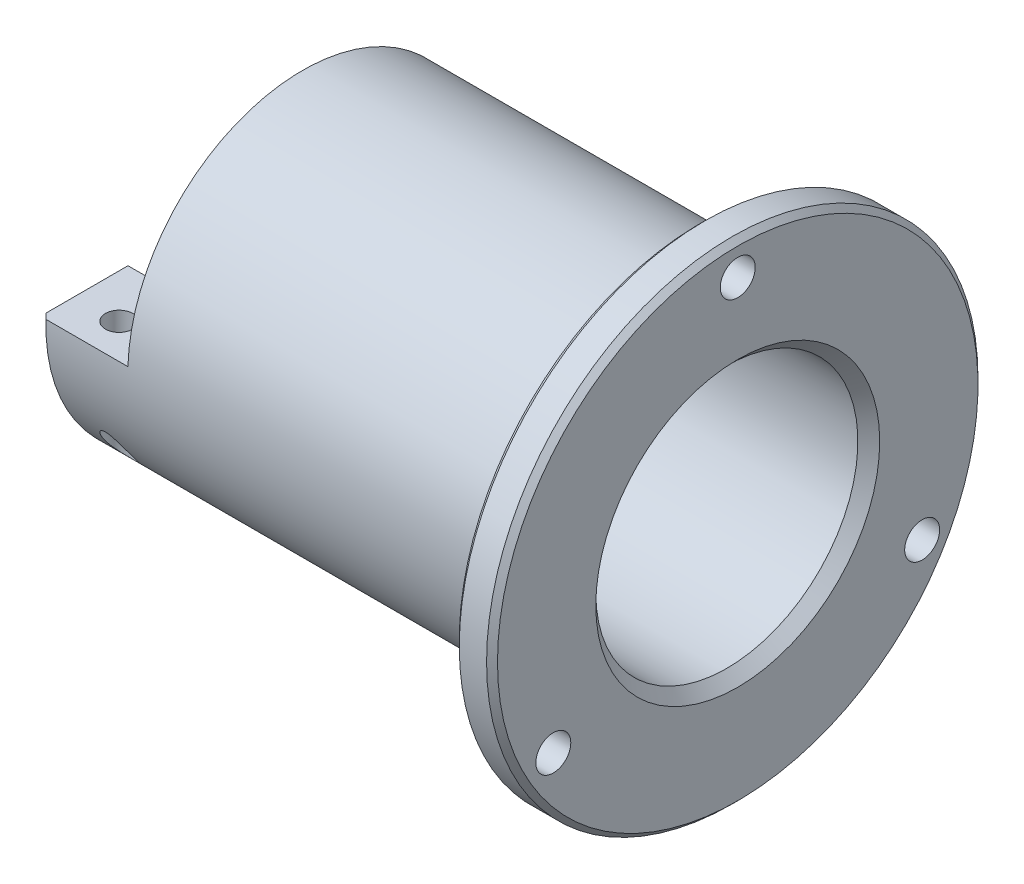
ISO-10303-21;
HEADER;
FILE_DESCRIPTION(('STEP AP214'),'2;1');
FILE_NAME('part.step','',(''),(''),'','','');
FILE_SCHEMA(('AUTOMOTIVE_DESIGN { 1 0 10303 214 1 1 1 1 }'));
ENDSEC;
DATA;
#1=APPLICATION_CONTEXT('core data for automotive mechanical design processes');
#2=APPLICATION_PROTOCOL_DEFINITION('international standard','automotive_design',2000,#1);
#3=PRODUCT_CONTEXT('',#1,'mechanical');
#4=PRODUCT('Part','Part','',(#3));
#5=PRODUCT_RELATED_PRODUCT_CATEGORY('part','',(#4));
#6=PRODUCT_DEFINITION_FORMATION('','',#4);
#7=PRODUCT_DEFINITION_CONTEXT('part definition',#1,'design');
#8=PRODUCT_DEFINITION('design','',#6,#7);
#9=PRODUCT_DEFINITION_SHAPE('','',#8);
#10=(LENGTH_UNIT() NAMED_UNIT(*) SI_UNIT(.MILLI.,.METRE.));
#11=(NAMED_UNIT(*) PLANE_ANGLE_UNIT() SI_UNIT($,.RADIAN.));
#12=(NAMED_UNIT(*) SI_UNIT($,.STERADIAN.) SOLID_ANGLE_UNIT());
#13=UNCERTAINTY_MEASURE_WITH_UNIT(LENGTH_MEASURE(1.E-05),#10,'distance_accuracy_value','');
#14=(GEOMETRIC_REPRESENTATION_CONTEXT(3) GLOBAL_UNCERTAINTY_ASSIGNED_CONTEXT((#13)) GLOBAL_UNIT_ASSIGNED_CONTEXT((#10,
#11,#12)) REPRESENTATION_CONTEXT('',''));
#15=CARTESIAN_POINT('',(0.,0.,0.));
#16=DIRECTION('',(0.,0.,1.));
#17=DIRECTION('',(1.,0.,0.));
#18=AXIS2_PLACEMENT_3D('',#15,#16,#17);
#19=CARTESIAN_POINT('',(0.,0.,0.));
#20=DIRECTION('',(-1.,0.,0.));
#21=DIRECTION('',(0.,0.,1.));
#22=AXIS2_PLACEMENT_3D('',#19,#20,#21);
#23=CYLINDRICAL_SURFACE('',#22,7.99999999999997);
#24=CARTESIAN_POINT('',(0.,0.,0.));
#25=DIRECTION('',(-1.,0.,0.));
#26=DIRECTION('',(0.,0.,1.));
#27=AXIS2_PLACEMENT_3D('',#24,#25,#26);
#28=CIRCLE('',#27,7.99999999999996);
#29=CARTESIAN_POINT('',(0.,0.5,-7.98435971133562));
#30=VERTEX_POINT('',#29);
#31=CARTESIAN_POINT('',(0.,0.5,7.98435971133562));
#32=VERTEX_POINT('',#31);
#33=EDGE_CURVE('E95',#30,#32,#28,.T.);
#34=ORIENTED_EDGE('',*,*,#33,.T.);
#35=DIRECTION('',(-1.,0.,0.));
#36=VECTOR('',#35,1.);
#37=CARTESIAN_POINT('',(8.,0.5,7.98435971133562));
#38=LINE('',#37,#36);
#39=CARTESIAN_POINT('',(8.,0.5,7.98435971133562));
#40=VERTEX_POINT('',#39);
#41=EDGE_CURVE('E97',#40,#32,#38,.T.);
#42=ORIENTED_EDGE('',*,*,#41,.F.);
#43=CARTESIAN_POINT('',(8.,0.,0.));
#44=DIRECTION('',(1.,0.,0.));
#45=DIRECTION('',(0.,0.,1.));
#46=AXIS2_PLACEMENT_3D('',#43,#44,#45);
#47=CIRCLE('',#46,7.99999999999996);
#48=CARTESIAN_POINT('',(8.,0.5,-7.98435971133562));
#49=VERTEX_POINT('',#48);
#50=EDGE_CURVE('E96',#49,#40,#47,.T.);
#51=ORIENTED_EDGE('',*,*,#50,.F.);
#52=DIRECTION('',(-1.,0.,0.));
#53=VECTOR('',#52,1.);
#54=CARTESIAN_POINT('',(8.,0.5,-7.98435971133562));
#55=LINE('',#54,#53);
#56=EDGE_CURVE('E79',#49,#30,#55,.T.);
#57=ORIENTED_EDGE('',*,*,#56,.T.);
#58=EDGE_LOOP('',(#34,#42,#51,#57));
#59=FACE_BOUND('',#58,.T.);
#60=CARTESIAN_POINT('',(9.4,0.,0.));
#61=DIRECTION('',(-1.,0.,0.));
#62=DIRECTION('',(0.,0.,1.));
#63=AXIS2_PLACEMENT_3D('',#60,#61,#62);
#64=CIRCLE('',#63,7.99999999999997);
#65=CARTESIAN_POINT('',(9.4,0.,7.99999999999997));
#66=VERTEX_POINT('',#65);
#67=EDGE_CURVE('E222',#66,#66,#64,.T.);
#68=ORIENTED_EDGE('',*,*,#67,.F.);
#69=EDGE_LOOP('',(#68));
#70=FACE_BOUND('',#69,.T.);
#71=ADVANCED_FACE('F29',(#59,#70),#23,.F.);
#72=CARTESIAN_POINT('',(0.,7.99999999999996,0.));
#73=DIRECTION('',(1.,0.,0.));
#74=DIRECTION('',(0.,0.,-1.));
#75=AXIS2_PLACEMENT_3D('',#72,#73,#74);
#76=PLANE('',#75);
#77=DIRECTION('',(0.,0.,1.));
#78=VECTOR('',#77,1.);
#79=CARTESIAN_POINT('',(0.,0.5,-15.9921855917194));
#80=LINE('',#79,#78);
#81=CARTESIAN_POINT('',(0.,0.5,-15.4919333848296));
#82=VERTEX_POINT('',#81);
#83=EDGE_CURVE('E76',#82,#30,#80,.T.);
#84=ORIENTED_EDGE('',*,*,#83,.F.);
#85=CARTESIAN_POINT('',(0.,0.,0.));
#86=DIRECTION('',(1.,0.,0.));
#87=DIRECTION('',(0.,0.,-1.));
#88=AXIS2_PLACEMENT_3D('',#85,#86,#87);
#89=CIRCLE('',#88,15.4999999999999);
#90=CARTESIAN_POINT('',(0.,0.5,15.4919333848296));
#91=VERTEX_POINT('',#90);
#92=EDGE_CURVE('E151',#82,#91,#89,.F.);
#93=ORIENTED_EDGE('',*,*,#92,.T.);
#94=DIRECTION('',(0.,0.,1.));
#95=VECTOR('',#94,1.);
#96=CARTESIAN_POINT('',(0.,0.5,7.98435971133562));
#97=LINE('',#96,#95);
#98=EDGE_CURVE('E87',#32,#91,#97,.T.);
#99=ORIENTED_EDGE('',*,*,#98,.F.);
#100=ORIENTED_EDGE('',*,*,#33,.F.);
#101=EDGE_LOOP('',(#84,#93,#99,#100));
#102=FACE_BOUND('',#101,.T.);
#103=ADVANCED_FACE('F101',(#102),#76,.F.);
#104=CARTESIAN_POINT('',(0.,0.,0.));
#105=DIRECTION('',(-1.,0.,0.));
#106=DIRECTION('',(0.,0.,1.));
#107=AXIS2_PLACEMENT_3D('',#104,#105,#106);
#108=CYLINDRICAL_SURFACE('',#107,15.9999999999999);
#109=CARTESIAN_POINT('',(43.85,0.,0.));
#110=DIRECTION('',(1.,0.,0.));
#111=DIRECTION('',(0.,0.,-1.));
#112=AXIS2_PLACEMENT_3D('',#109,#110,#111);
#113=CIRCLE('',#112,15.9999999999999);
#114=CARTESIAN_POINT('',(43.85,0.,-15.9999999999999));
#115=VERTEX_POINT('',#114);
#116=EDGE_CURVE('E36',#115,#115,#113,.F.);
#117=ORIENTED_EDGE('',*,*,#116,.T.);
#118=EDGE_LOOP('',(#117));
#119=FACE_BOUND('',#118,.T.);
#120=CARTESIAN_POINT('',(4.,-7.65490039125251,14.05));
#121=CARTESIAN_POINT('',(4.03648893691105,-7.65490362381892,14.0499983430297));
#122=CARTESIAN_POINT('',(4.0729920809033,-7.65786623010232,14.0483853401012));
#123=CARTESIAN_POINT('',(4.14483776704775,-7.66937298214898,14.0421066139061));
#124=CARTESIAN_POINT('',(4.18017886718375,-7.67792380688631,14.0374372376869));
#125=CARTESIAN_POINT('',(4.25747048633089,-7.7024947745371,14.0239727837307));
#126=CARTESIAN_POINT('',(4.29886138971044,-7.71984872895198,14.0144376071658));
#127=CARTESIAN_POINT('',(4.37793517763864,-7.7600660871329,13.9922086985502));
#128=CARTESIAN_POINT('',(4.41561000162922,-7.78294111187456,13.9795083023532));
#129=CARTESIAN_POINT('',(4.50929466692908,-7.84782819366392,13.9432303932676));
#130=CARTESIAN_POINT('',(4.56237255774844,-7.89297095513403,13.9177600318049));
#131=CARTESIAN_POINT('',(4.66042526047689,-7.98914034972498,13.8627824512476));
#132=CARTESIAN_POINT('',(4.70537832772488,-8.04018218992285,13.8332647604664));
#133=CARTESIAN_POINT('',(4.78563981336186,-8.14220535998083,13.7734436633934));
#134=CARTESIAN_POINT('',(4.82139814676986,-8.19295096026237,13.7433328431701));
#135=CARTESIAN_POINT('',(4.88785424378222,-8.29649931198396,13.6810728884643));
#136=CARTESIAN_POINT('',(4.91854784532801,-8.34930371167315,13.6489221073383));
#137=CARTESIAN_POINT('',(4.97546693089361,-8.45635377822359,13.5828585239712));
#138=CARTESIAN_POINT('',(5.00168369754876,-8.51060202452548,13.5489424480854));
#139=CARTESIAN_POINT('',(5.04995750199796,-8.61999147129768,13.4796122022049));
#140=CARTESIAN_POINT('',(5.07201343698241,-8.67513290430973,13.4441976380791));
#141=CARTESIAN_POINT('',(5.12141217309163,-8.81136989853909,13.3554876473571));
#142=CARTESIAN_POINT('',(5.14654629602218,-8.89277996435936,13.3014349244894));
#143=CARTESIAN_POINT('',(5.18880238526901,-9.05602520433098,13.1908355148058));
#144=CARTESIAN_POINT('',(5.20592019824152,-9.13786057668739,13.1342875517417));
#145=CARTESIAN_POINT('',(5.23206575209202,-9.30125401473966,13.0190880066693));
#146=CARTESIAN_POINT('',(5.24110007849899,-9.38281225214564,12.9604381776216));
#147=CARTESIAN_POINT('',(5.25073912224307,-9.54508531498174,12.8413969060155));
#148=CARTESIAN_POINT('',(5.25134820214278,-9.62580055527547,12.7810063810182));
#149=CARTESIAN_POINT('',(5.2419832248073,-9.81725162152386,12.6349189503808));
#150=CARTESIAN_POINT('',(5.22776313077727,-9.92734089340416,12.548589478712));
#151=CARTESIAN_POINT('',(5.17909455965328,-10.1424483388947,12.3753660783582));
#152=CARTESIAN_POINT('',(5.14468765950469,-10.247476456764,12.2884736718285));
#153=CARTESIAN_POINT('',(5.06697128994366,-10.4160662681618,12.1455150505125));
#154=CARTESIAN_POINT('',(5.03023867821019,-10.4819685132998,12.0886489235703));
#155=CARTESIAN_POINT('',(4.94434894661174,-10.6081682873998,11.9780527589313));
#156=CARTESIAN_POINT('',(4.89520836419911,-10.6684731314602,11.9243186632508));
#157=CARTESIAN_POINT('',(4.79793845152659,-10.7660230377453,11.8362106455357));
#158=CARTESIAN_POINT('',(4.75295792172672,-10.8051560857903,11.8004673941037));
#159=CARTESIAN_POINT('',(4.65522227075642,-10.8774572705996,11.7338538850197));
#160=CARTESIAN_POINT('',(4.60247844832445,-10.9106339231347,11.7029766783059));
#161=CARTESIAN_POINT('',(4.5010628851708,-10.9631921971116,11.6537309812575));
#162=CARTESIAN_POINT('',(4.45375583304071,-10.9840073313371,11.6340957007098));
#163=CARTESIAN_POINT('',(4.35505332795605,-11.0196365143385,11.6003540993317));
#164=CARTESIAN_POINT('',(4.30366032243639,-11.0344541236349,11.5862444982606));
#165=CARTESIAN_POINT('',(4.19763257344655,-11.0572103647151,11.5645300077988));
#166=CARTESIAN_POINT('',(4.14297828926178,-11.0651018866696,11.5569696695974));
#167=CARTESIAN_POINT('',(4.03258839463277,-11.0732087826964,11.5492026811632));
#168=CARTESIAN_POINT('',(3.97685330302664,-11.0734277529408,11.5489925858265));
#169=CARTESIAN_POINT('',(3.8724547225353,-11.0665879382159,11.555546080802));
#170=CARTESIAN_POINT('',(3.82368643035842,-11.0603252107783,11.5615468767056));
#171=CARTESIAN_POINT('',(3.72823269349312,-11.0421190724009,11.5789361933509));
#172=CARTESIAN_POINT('',(3.68154743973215,-11.0301751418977,11.5903252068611));
#173=CARTESIAN_POINT('',(3.58981961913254,-11.0007989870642,11.618211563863));
#174=CARTESIAN_POINT('',(3.54487510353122,-10.9832057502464,11.6348585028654));
#175=CARTESIAN_POINT('',(3.45887288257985,-10.9434907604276,11.6722215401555));
#176=CARTESIAN_POINT('',(3.41781716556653,-10.9213667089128,11.6929397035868));
#177=CARTESIAN_POINT('',(3.31929514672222,-10.8607109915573,11.7493591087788));
#178=CARTESIAN_POINT('',(3.26458796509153,-10.8196783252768,11.7872010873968));
#179=CARTESIAN_POINT('',(3.16477159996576,-10.7312323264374,11.8677825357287));
#180=CARTESIAN_POINT('',(3.11968623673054,-10.683803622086,11.9105337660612));
#181=CARTESIAN_POINT('',(3.01991714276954,-10.5615999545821,12.0192324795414));
#182=CARTESIAN_POINT('',(2.97025853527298,-10.4842309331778,12.0868543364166));
#183=CARTESIAN_POINT('',(2.88738709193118,-10.3232816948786,12.2246124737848));
#184=CARTESIAN_POINT('',(2.85420123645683,-10.2396915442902,12.2947526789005));
#185=CARTESIAN_POINT('',(2.8087001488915,-10.0903899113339,12.4173611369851));
#186=CARTESIAN_POINT('',(2.79322051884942,-10.0255566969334,12.469773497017));
#187=CARTESIAN_POINT('',(2.76939347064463,-9.89424925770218,12.574214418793));
#188=CARTESIAN_POINT('',(2.76104957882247,-9.82777423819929,12.626242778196));
#189=CARTESIAN_POINT('',(2.75090563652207,-9.69358217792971,12.7295582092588));
#190=CARTESIAN_POINT('',(2.74911770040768,-9.62586307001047,12.7808437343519));
#191=CARTESIAN_POINT('',(2.75167923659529,-9.48968835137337,12.8822755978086));
#192=CARTESIAN_POINT('',(2.75602951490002,-9.42123264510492,12.9324217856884));
#193=CARTESIAN_POINT('',(2.77085410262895,-9.28130971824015,13.0332270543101));
#194=CARTESIAN_POINT('',(2.78155711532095,-9.20982778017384,13.0838319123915));
#195=CARTESIAN_POINT('',(2.80909882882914,-9.06687677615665,13.1832971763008));
#196=CARTESIAN_POINT('',(2.82593506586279,-8.99540771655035,13.2321582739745));
#197=CARTESIAN_POINT('',(2.8657123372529,-8.85309185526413,13.3277939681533));
#198=CARTESIAN_POINT('',(2.88863508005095,-8.78224383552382,13.3745743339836));
#199=CARTESIAN_POINT('',(2.94084594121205,-8.64151597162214,13.4659285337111));
#200=CARTESIAN_POINT('',(2.97013062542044,-8.57163562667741,13.5105035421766));
#201=CARTESIAN_POINT('',(3.03558039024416,-8.43362400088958,13.5970810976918));
#202=CARTESIAN_POINT('',(3.07173776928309,-8.36549085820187,13.6390864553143));
#203=CARTESIAN_POINT('',(3.15204816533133,-8.23179312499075,13.7201928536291));
#204=CARTESIAN_POINT('',(3.19622518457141,-8.16623698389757,13.7592846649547));
#205=CARTESIAN_POINT('',(3.269983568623,-8.07111402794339,13.8151548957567));
#206=CARTESIAN_POINT('',(3.29604461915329,-8.0397168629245,13.8334444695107));
#207=CARTESIAN_POINT('',(3.35089880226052,-7.9786540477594,13.868753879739));
#208=CARTESIAN_POINT('',(3.37969349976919,-7.94898940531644,13.8857729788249));
#209=CARTESIAN_POINT('',(3.47038003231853,-7.86376406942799,13.9343238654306));
#210=CARTESIAN_POINT('',(3.53696623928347,-7.81143439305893,13.9636632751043));
#211=CARTESIAN_POINT('',(3.64328250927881,-7.7486882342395,13.9985124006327));
#212=CARTESIAN_POINT('',(3.67742592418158,-7.73112245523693,14.0082137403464));
#213=CARTESIAN_POINT('',(3.74837454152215,-7.7007155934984,14.024951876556));
#214=CARTESIAN_POINT('',(3.78517468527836,-7.68786580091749,14.0319935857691));
#215=CARTESIAN_POINT('',(3.85167189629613,-7.67047337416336,14.0415068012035));
#216=CARTESIAN_POINT('',(3.88094090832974,-7.66467454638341,14.0446710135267));
#217=CARTESIAN_POINT('',(3.94013682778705,-7.65688702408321,14.0489181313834));
#218=CARTESIAN_POINT('',(3.97006363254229,-7.65489773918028,14.0500013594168));
#219=CARTESIAN_POINT('',(4.,-7.65490039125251,14.05));
#220=B_SPLINE_CURVE_WITH_KNOTS('',3,(#120,#121,#122,#123,#124,#125,#126,#127,#128,#129,#130,
#131,#132,#133,#134,#135,#136,#137,#138,#139,#140,#141,#142,#143,#144,#145,#146,#147,#148,#149,
#150,#151,#152,#153,#154,#155,#156,#157,#158,#159,#160,#161,#162,#163,#164,#165,#166,#167,#168,
#169,#170,#171,#172,#173,#174,#175,#176,#177,#178,#179,#180,#181,#182,#183,#184,#185,#186,#187,
#188,#189,#190,#191,#192,#193,#194,#195,#196,#197,#198,#199,#200,#201,#202,#203,#204,#205,#206,
#207,#208,#209,#210,#211,#212,#213,#214,#215,#216,#217,#218,#219),.UNSPECIFIED.,.T.,.F.,(4,2,2,
2,2,2,2,2,2,2,2,2,2,2,2,2,2,2,2,2,2,2,2,2,2,2,2,2,2,2,2,2,2,2,2,2,2,2,2,2,2,2,2,2,2,2,2,2,2,4),
(0.,0.109344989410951,0.218820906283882,0.355696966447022,0.492863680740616,0.714183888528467,
0.93608792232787,1.14277957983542,1.34964025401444,1.55689924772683,1.76421309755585,
2.06652562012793,2.36899460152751,2.67121693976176,2.97328278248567,3.39386366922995,
3.81358134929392,4.09623022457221,4.3785043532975,4.58636155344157,4.79391917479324,
4.95913020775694,5.12424301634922,5.29047037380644,5.4566198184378,5.60453524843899,
5.752464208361,5.90505238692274,6.057718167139,6.29086798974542,6.52458848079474,
6.86508628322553,7.206139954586,7.46019905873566,7.71438364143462,7.96903768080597,
8.22372516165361,8.4881906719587,8.75255006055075,9.01612379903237,9.27955561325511,
9.54269394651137,9.80663322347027,9.94064392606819,10.0747318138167,10.3407199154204,
10.4591887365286,10.5774376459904,10.6671607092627,10.7568698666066),.UNSPECIFIED.);
#221=CARTESIAN_POINT('',(4.,-7.65490039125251,14.05));
#222=VERTEX_POINT('',#221);
#223=EDGE_CURVE('E245',#222,#222,#220,.T.);
#224=ORIENTED_EDGE('',*,*,#223,.T.);
#225=EDGE_LOOP('',(#224));
#226=FACE_BOUND('',#225,.T.);
#227=CARTESIAN_POINT('',(4.,-11.0723755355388,-11.55));
#228=CARTESIAN_POINT('',(4.0545492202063,-11.0723755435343,-11.5500000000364));
#229=CARTESIAN_POINT('',(4.10909868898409,-11.0686249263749,-11.553599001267));
#230=CARTESIAN_POINT('',(4.21630031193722,-11.0539200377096,-11.5676683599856));
#231=CARTESIAN_POINT('',(4.26895161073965,-11.0429625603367,-11.5781417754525));
#232=CARTESIAN_POINT('',(4.37050724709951,-11.0147089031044,-11.6050230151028));
#233=CARTESIAN_POINT('',(4.41943276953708,-10.9974523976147,-11.62139368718));
#234=CARTESIAN_POINT('',(4.51300269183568,-10.9575738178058,-11.6590020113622));
#235=CARTESIAN_POINT('',(4.55764500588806,-10.9349491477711,-11.6802420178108));
#236=CARTESIAN_POINT('',(4.65915653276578,-10.875372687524,-11.7357788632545));
#237=CARTESIAN_POINT('',(4.71378409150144,-10.8363083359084,-11.771901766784));
#238=CARTESIAN_POINT('',(4.81383100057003,-10.751831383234,-11.8491105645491));
#239=CARTESIAN_POINT('',(4.85923096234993,-10.7064057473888,-11.8902066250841));
#240=CARTESIAN_POINT('',(4.95989677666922,-10.5893981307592,-11.9947161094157));
#241=CARTESIAN_POINT('',(5.01038662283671,-10.5152550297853,-12.0598398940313));
#242=CARTESIAN_POINT('',(5.09551492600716,-10.3607083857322,-12.1928744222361));
#243=CARTESIAN_POINT('',(5.13012447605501,-10.2802937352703,-12.2607900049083));
#244=CARTESIAN_POINT('',(5.17858463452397,-10.1362561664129,-12.3799324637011));
#245=CARTESIAN_POINT('',(5.19547017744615,-10.073519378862,-12.4310438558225));
#246=CARTESIAN_POINT('',(5.22229638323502,-9.94634891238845,-12.5330277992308));
#247=CARTESIAN_POINT('',(5.23223358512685,-9.88191440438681,-12.5839002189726));
#248=CARTESIAN_POINT('',(5.24574644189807,-9.75177501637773,-12.6850182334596));
#249=CARTESIAN_POINT('',(5.24931332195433,-9.68606850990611,-12.7352628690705));
#250=CARTESIAN_POINT('',(5.25050685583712,-9.55384611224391,-12.8347524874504));
#251=CARTESIAN_POINT('',(5.24813266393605,-9.48733010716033,-12.8839973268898));
#252=CARTESIAN_POINT('',(5.23754932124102,-9.35115825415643,-12.9831897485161));
#253=CARTESIAN_POINT('',(5.22911022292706,-9.28148337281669,-13.033086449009));
#254=CARTESIAN_POINT('',(5.20635237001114,-9.14201657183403,-13.131291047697));
#255=CARTESIAN_POINT('',(5.19203577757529,-9.07222470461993,-13.1795995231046));
#256=CARTESIAN_POINT('',(5.15758789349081,-8.93297876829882,-13.27437272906));
#257=CARTESIAN_POINT('',(5.13746532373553,-8.86352435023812,-13.3208401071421));
#258=CARTESIAN_POINT('',(5.09125565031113,-8.7253250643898,-13.4117687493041));
#259=CARTESIAN_POINT('',(5.06517096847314,-8.65657992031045,-13.4562308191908));
#260=CARTESIAN_POINT('',(5.00181053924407,-8.50909031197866,-13.5500636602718));
#261=CARTESIAN_POINT('',(4.96339765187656,-8.43057134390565,-13.5990309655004));
#262=CARTESIAN_POINT('',(4.87674630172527,-8.27662790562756,-13.6932663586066));
#263=CARTESIAN_POINT('',(4.82850647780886,-8.20120386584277,-13.7385339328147));
#264=CARTESIAN_POINT('',(4.73296666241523,-8.07340036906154,-13.8139186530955));
#265=CARTESIAN_POINT('',(4.68815313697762,-8.0197956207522,-13.8450839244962));
#266=CARTESIAN_POINT('',(4.59016248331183,-7.91829070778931,-13.9033827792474));
#267=CARTESIAN_POINT('',(4.5370089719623,-7.87037508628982,-13.9305273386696));
#268=CARTESIAN_POINT('',(4.44560173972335,-7.80280406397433,-13.9684309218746));
#269=CARTESIAN_POINT('',(4.41068031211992,-7.77981923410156,-13.9812366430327));
#270=CARTESIAN_POINT('',(4.33741367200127,-7.73838876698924,-14.0042099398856));
#271=CARTESIAN_POINT('',(4.29907305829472,-7.71993715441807,-14.0143809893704));
#272=CARTESIAN_POINT('',(4.22597362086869,-7.69174250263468,-14.0298722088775));
#273=CARTESIAN_POINT('',(4.19169692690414,-7.68105673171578,-14.0357205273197));
#274=CARTESIAN_POINT('',(4.12158632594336,-7.66485941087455,-14.0445725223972));
#275=CARTESIAN_POINT('',(4.08575415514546,-7.65934223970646,-14.0475792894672));
#276=CARTESIAN_POINT('',(4.01337124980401,-7.65406632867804,-14.0504547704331));
#277=CARTESIAN_POINT('',(3.97681807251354,-7.65433267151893,-14.0503098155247));
#278=CARTESIAN_POINT('',(3.90436594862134,-7.66065213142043,-14.0468651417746));
#279=CARTESIAN_POINT('',(3.86846743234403,-7.66670892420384,-14.0435634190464));
#280=CARTESIAN_POINT('',(3.79286406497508,-7.68530324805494,-14.0333973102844));
#281=CARTESIAN_POINT('',(3.75344008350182,-7.69870501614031,-14.0260571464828));
#282=CARTESIAN_POINT('',(3.67760182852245,-7.73089667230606,-14.0083394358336));
#283=CARTESIAN_POINT('',(3.64119317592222,-7.74969634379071,-13.9979563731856));
#284=CARTESIAN_POINT('',(3.55273790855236,-7.80251107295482,-13.9686129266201));
#285=CARTESIAN_POINT('',(3.50287705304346,-7.83925755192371,-13.9480499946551));
#286=CARTESIAN_POINT('',(3.40995476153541,-7.91855417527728,-13.9031864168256));
#287=CARTESIAN_POINT('',(3.36691158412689,-7.96111935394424,-13.8788760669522));
#288=CARTESIAN_POINT('',(3.28991723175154,-8.04629365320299,-13.8296559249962));
#289=CARTESIAN_POINT('',(3.25551181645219,-8.08861930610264,-13.8049546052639));
#290=CARTESIAN_POINT('',(3.19094493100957,-8.17539271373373,-13.7537448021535));
#291=CARTESIAN_POINT('',(3.16078694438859,-8.21984217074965,-13.7272348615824));
#292=CARTESIAN_POINT('',(3.10418970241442,-8.31027152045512,-13.6726801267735));
#293=CARTESIAN_POINT('',(3.07775747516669,-8.35625410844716,-13.6446325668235));
#294=CARTESIAN_POINT('',(3.02831111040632,-8.44924660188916,-13.5872448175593));
#295=CARTESIAN_POINT('',(3.0052980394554,-8.49625682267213,-13.5579042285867));
#296=CARTESIAN_POINT('',(2.94888681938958,-8.62092163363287,-13.4791711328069));
#297=CARTESIAN_POINT('',(2.9181149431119,-8.69917004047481,-13.4288230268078));
#298=CARTESIAN_POINT('',(2.86433401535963,-8.85662862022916,-13.3255024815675));
#299=CARTESIAN_POINT('',(2.84132981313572,-8.93583936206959,-13.2725284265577));
#300=CARTESIAN_POINT('',(2.80287631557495,-9.09456757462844,-13.1642721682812));
#301=CARTESIAN_POINT('',(2.78742947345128,-9.17408513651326,-13.1089892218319));
#302=CARTESIAN_POINT('',(2.76420480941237,-9.33278270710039,-12.9964861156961));
#303=CARTESIAN_POINT('',(2.75642391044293,-9.41196283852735,-12.9392667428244));
#304=CARTESIAN_POINT('',(2.74646652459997,-9.61934949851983,-12.7864570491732));
#305=CARTESIAN_POINT('',(2.75092468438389,-9.74696454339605,-12.6894376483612));
#306=CARTESIAN_POINT('',(2.77582211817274,-9.93447541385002,-12.5424299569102));
#307=CARTESIAN_POINT('',(2.78714165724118,-9.99628413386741,-12.4932168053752));
#308=CARTESIAN_POINT('',(2.81642162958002,-10.1182031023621,-12.3946799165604));
#309=CARTESIAN_POINT('',(2.83437864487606,-10.1783142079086,-12.3453562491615));
#310=CARTESIAN_POINT('',(2.88309608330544,-10.3112130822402,-12.2347097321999));
#311=CARTESIAN_POINT('',(2.9159467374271,-10.3833585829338,-12.1735095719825));
#312=CARTESIAN_POINT('',(2.99479049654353,-10.522378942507,-12.0535442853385));
#313=CARTESIAN_POINT('',(3.0407687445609,-10.5892596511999,-11.9947764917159));
#314=CARTESIAN_POINT('',(3.13418087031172,-10.6993530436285,-11.8965483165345));
#315=CARTESIAN_POINT('',(3.17835393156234,-10.7442933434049,-11.8559436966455));
#316=CARTESIAN_POINT('',(3.27562924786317,-10.8281432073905,-11.7794107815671));
#317=CARTESIAN_POINT('',(3.32871774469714,-10.8670618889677,-11.7434754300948));
#318=CARTESIAN_POINT('',(3.43052685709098,-10.9287010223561,-11.6860963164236));
#319=CARTESIAN_POINT('',(3.47742510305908,-10.9530866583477,-11.6632223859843));
#320=CARTESIAN_POINT('',(3.57605897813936,-10.9958834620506,-11.622883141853));
#321=CARTESIAN_POINT('',(3.62779060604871,-11.014299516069,-11.6054134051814));
#322=CARTESIAN_POINT('',(3.732161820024,-11.0432101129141,-11.5779053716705));
#323=CARTESIAN_POINT('',(3.78460477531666,-11.0540757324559,-11.567519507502));
#324=CARTESIAN_POINT('',(3.89136568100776,-11.0686567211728,-11.5535684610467));
#325=CARTESIAN_POINT('',(3.94568271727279,-11.0723755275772,-11.5499999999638));
#326=CARTESIAN_POINT('',(4.,-11.0723755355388,-11.55));
#327=B_SPLINE_CURVE_WITH_KNOTS('',3,(#227,#228,#229,#230,#231,#232,#233,#234,#235,#236,#237,
#238,#239,#240,#241,#242,#243,#244,#245,#246,#247,#248,#249,#250,#251,#252,#253,#254,#255,#256,
#257,#258,#259,#260,#261,#262,#263,#264,#265,#266,#267,#268,#269,#270,#271,#272,#273,#274,#275,
#276,#277,#278,#279,#280,#281,#282,#283,#284,#285,#286,#287,#288,#289,#290,#291,#292,#293,#294,
#295,#296,#297,#298,#299,#300,#301,#302,#303,#304,#305,#306,#307,#308,#309,#310,#311,#312,#313,
#314,#315,#316,#317,#318,#319,#320,#321,#322,#323,#324,#325,#326),.UNSPECIFIED.,.T.,.F.,(4,2,2,
2,2,2,2,2,2,2,2,2,2,2,2,2,2,2,2,2,2,2,2,2,2,2,2,2,2,2,2,2,2,2,2,2,2,2,2,2,2,2,2,2,2,2,2,2,2,4),
(0.,0.163412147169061,0.326897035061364,0.489369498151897,0.651920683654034,0.87942060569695,
1.10739370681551,1.43811756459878,1.76944107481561,2.01711782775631,2.26491786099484,
2.51305896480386,2.76123539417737,3.01935417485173,3.27737808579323,3.53501638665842,
3.79255021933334,4.09265409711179,4.39279957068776,4.62181571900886,4.85019467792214,
4.98103277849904,5.11169748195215,5.22038601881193,5.32895621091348,5.43799735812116,
5.54710776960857,5.67325461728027,5.79963155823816,5.99432399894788,6.18952934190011,
6.36890510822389,6.548427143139,6.72828341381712,6.90819567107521,7.20179005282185,
7.4955673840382,7.78944001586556,8.08319464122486,8.56231247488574,8.80152831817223,
9.04062114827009,9.34022887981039,9.6394988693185,9.86366699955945,10.0874923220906,
10.2596307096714,10.4316278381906,10.5944234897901,10.7571408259),.UNSPECIFIED.);
#328=CARTESIAN_POINT('',(4.,-11.0723755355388,-11.55));
#329=VERTEX_POINT('',#328);
#330=EDGE_CURVE('E88',#329,#329,#327,.T.);
#331=ORIENTED_EDGE('',*,*,#330,.T.);
#332=EDGE_LOOP('',(#331));
#333=FACE_BOUND('',#332,.T.);
#334=DIRECTION('',(-1.,0.,0.));
#335=VECTOR('',#334,1.);
#336=CARTESIAN_POINT('',(8.,0.5,15.9921855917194));
#337=LINE('',#336,#335);
#338=CARTESIAN_POINT('',(8.,0.5,15.9921855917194));
#339=VERTEX_POINT('',#338);
#340=CARTESIAN_POINT('',(0.500000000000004,0.5,15.9921855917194));
#341=VERTEX_POINT('',#340);
#342=EDGE_CURVE('E223',#339,#341,#337,.T.);
#343=ORIENTED_EDGE('',*,*,#342,.T.);
#344=CARTESIAN_POINT('',(0.500000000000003,0.,0.));
#345=DIRECTION('',(1.,0.,0.));
#346=DIRECTION('',(0.,0.,-1.));
#347=AXIS2_PLACEMENT_3D('',#344,#345,#346);
#348=CIRCLE('',#347,15.9999999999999);
#349=CARTESIAN_POINT('',(0.500000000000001,0.5,-15.9921855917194));
#350=VERTEX_POINT('',#349);
#351=EDGE_CURVE('E43',#341,#350,#348,.T.);
#352=ORIENTED_EDGE('',*,*,#351,.T.);
#353=DIRECTION('',(-1.,0.,0.));
#354=VECTOR('',#353,1.);
#355=CARTESIAN_POINT('',(8.,0.5,-15.9921855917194));
#356=LINE('',#355,#354);
#357=CARTESIAN_POINT('',(8.,0.5,-15.9921855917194));
#358=VERTEX_POINT('',#357);
#359=EDGE_CURVE('E98',#358,#350,#356,.T.);
#360=ORIENTED_EDGE('',*,*,#359,.F.);
#361=CARTESIAN_POINT('',(8.,0.,0.));
#362=DIRECTION('',(-1.,0.,0.));
#363=DIRECTION('',(0.,0.,1.));
#364=AXIS2_PLACEMENT_3D('',#361,#362,#363);
#365=CIRCLE('',#364,15.9999999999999);
#366=EDGE_CURVE('E239',#339,#358,#365,.T.);
#367=ORIENTED_EDGE('',*,*,#366,.F.);
#368=EDGE_LOOP('',(#343,#352,#360,#367));
#369=FACE_BOUND('',#368,.T.);
#370=ADVANCED_FACE('F120',(#119,#226,#333,#369),#108,.T.);
#371=CARTESIAN_POINT('',(44.35,15.9999999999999,0.));
#372=DIRECTION('',(1.,0.,0.));
#373=DIRECTION('',(0.,0.,-1.));
#374=AXIS2_PLACEMENT_3D('',#371,#372,#373);
#375=PLANE('',#374);
#376=CARTESIAN_POINT('',(44.35,0.,0.));
#377=DIRECTION('',(1.,0.,0.));
#378=DIRECTION('',(0.,0.,-1.));
#379=AXIS2_PLACEMENT_3D('',#376,#377,#378);
#380=CIRCLE('',#379,16.4999999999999);
#381=CARTESIAN_POINT('',(44.35,0.,-16.4999999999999));
#382=VERTEX_POINT('',#381);
#383=EDGE_CURVE('E11',#382,#382,#380,.T.);
#384=ORIENTED_EDGE('',*,*,#383,.T.);
#385=EDGE_LOOP('',(#384));
#386=FACE_BOUND('',#385,.T.);
#387=CARTESIAN_POINT('',(44.35,0.,0.));
#388=DIRECTION('',(1.,0.,0.));
#389=DIRECTION('',(0.,0.,-1.));
#390=AXIS2_PLACEMENT_3D('',#387,#388,#389);
#391=CIRCLE('',#390,22.);
#392=CARTESIAN_POINT('',(44.35,0.,-22.));
#393=VERTEX_POINT('',#392);
#394=EDGE_CURVE('E312',#393,#393,#391,.F.);
#395=ORIENTED_EDGE('',*,*,#394,.T.);
#396=EDGE_LOOP('',(#395));
#397=FACE_BOUND('',#396,.T.);
#398=CARTESIAN_POINT('',(44.35,-9.74999999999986,-16.8874953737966));
#399=DIRECTION('',(1.,0.,0.));
#400=DIRECTION('',(0.,0.,-1.));
#401=AXIS2_PLACEMENT_3D('',#398,#399,#400);
#402=CIRCLE('',#401,1.6);
#403=CARTESIAN_POINT('',(44.35,-9.74999999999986,-18.4874953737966));
#404=VERTEX_POINT('',#403);
#405=EDGE_CURVE('E265',#404,#404,#402,.T.);
#406=ORIENTED_EDGE('',*,*,#405,.T.);
#407=EDGE_LOOP('',(#406));
#408=FACE_BOUND('',#407,.T.);
#409=CARTESIAN_POINT('',(44.35,-9.75000000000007,16.8874953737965));
#410=DIRECTION('',(1.,0.,0.));
#411=DIRECTION('',(0.,0.,-1.));
#412=AXIS2_PLACEMENT_3D('',#409,#410,#411);
#413=CIRCLE('',#412,1.6);
#414=CARTESIAN_POINT('',(44.35,-9.75000000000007,15.2874953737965));
#415=VERTEX_POINT('',#414);
#416=EDGE_CURVE('E259',#415,#415,#413,.T.);
#417=ORIENTED_EDGE('',*,*,#416,.T.);
#418=EDGE_LOOP('',(#417));
#419=FACE_BOUND('',#418,.T.);
#420=CARTESIAN_POINT('',(44.35,19.5,0.));
#421=DIRECTION('',(1.,0.,0.));
#422=DIRECTION('',(0.,0.,-1.));
#423=AXIS2_PLACEMENT_3D('',#420,#421,#422);
#424=CIRCLE('',#423,1.6);
#425=CARTESIAN_POINT('',(44.35,19.5,-1.6));
#426=VERTEX_POINT('',#425);
#427=EDGE_CURVE('E253',#426,#426,#424,.T.);
#428=ORIENTED_EDGE('',*,*,#427,.T.);
#429=EDGE_LOOP('',(#428));
#430=FACE_BOUND('',#429,.T.);
#431=ADVANCED_FACE('F184',(#386,#397,#408,#419,#430),#375,.F.);
#432=CARTESIAN_POINT('',(0.,0.,0.));
#433=DIRECTION('',(-1.,0.,0.));
#434=DIRECTION('',(0.,0.,1.));
#435=AXIS2_PLACEMENT_3D('',#432,#433,#434);
#436=CYLINDRICAL_SURFACE('',#435,22.5);
#437=CARTESIAN_POINT('',(44.85,0.,0.));
#438=DIRECTION('',(1.,0.,0.));
#439=DIRECTION('',(0.,0.,-1.));
#440=AXIS2_PLACEMENT_3D('',#437,#438,#439);
#441=CIRCLE('',#440,22.5);
#442=CARTESIAN_POINT('',(44.85,0.,-22.5));
#443=VERTEX_POINT('',#442);
#444=EDGE_CURVE('E309',#443,#443,#441,.T.);
#445=ORIENTED_EDGE('',*,*,#444,.T.);
#446=EDGE_LOOP('',(#445));
#447=FACE_BOUND('',#446,.T.);
#448=CARTESIAN_POINT('',(47.35,0.,0.));
#449=DIRECTION('',(-1.,0.,0.));
#450=DIRECTION('',(0.,0.,1.));
#451=AXIS2_PLACEMENT_3D('',#448,#449,#450);
#452=CIRCLE('',#451,22.5);
#453=CARTESIAN_POINT('',(47.35,0.,22.5));
#454=VERTEX_POINT('',#453);
#455=EDGE_CURVE('E313',#454,#454,#452,.T.);
#456=ORIENTED_EDGE('',*,*,#455,.T.);
#457=EDGE_LOOP('',(#456));
#458=FACE_BOUND('',#457,.T.);
#459=ADVANCED_FACE('F188',(#447,#458),#436,.T.);
#460=CARTESIAN_POINT('',(47.85,22.5,0.));
#461=DIRECTION('',(-1.,0.,0.));
#462=DIRECTION('',(0.,0.,1.));
#463=AXIS2_PLACEMENT_3D('',#460,#461,#462);
#464=PLANE('',#463);
#465=CARTESIAN_POINT('',(47.85,0.,0.));
#466=DIRECTION('',(-1.,0.,0.));
#467=DIRECTION('',(0.,0.,1.));
#468=AXIS2_PLACEMENT_3D('',#465,#466,#467);
#469=CIRCLE('',#468,22.);
#470=CARTESIAN_POINT('',(47.85,0.,22.));
#471=VERTEX_POINT('',#470);
#472=EDGE_CURVE('E319',#471,#471,#469,.F.);
#473=ORIENTED_EDGE('',*,*,#472,.T.);
#474=EDGE_LOOP('',(#473));
#475=FACE_BOUND('',#474,.T.);
#476=CARTESIAN_POINT('',(47.85,0.,0.));
#477=DIRECTION('',(-1.,0.,0.));
#478=DIRECTION('',(0.,0.,1.));
#479=AXIS2_PLACEMENT_3D('',#476,#477,#478);
#480=CIRCLE('',#479,13.);
#481=CARTESIAN_POINT('',(47.85,0.,13.));
#482=VERTEX_POINT('',#481);
#483=EDGE_CURVE('E102',#482,#482,#480,.T.);
#484=ORIENTED_EDGE('',*,*,#483,.T.);
#485=EDGE_LOOP('',(#484));
#486=FACE_BOUND('',#485,.T.);
#487=CARTESIAN_POINT('',(47.85,-9.74999999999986,-16.8874953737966));
#488=DIRECTION('',(1.,0.,0.));
#489=DIRECTION('',(0.,-0.866025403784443,0.499999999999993));
#490=AXIS2_PLACEMENT_3D('',#487,#488,#489);
#491=CIRCLE('',#490,1.6);
#492=CARTESIAN_POINT('',(47.85,-11.135640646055,-16.0874953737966));
#493=VERTEX_POINT('',#492);
#494=EDGE_CURVE('E268',#493,#493,#491,.T.);
#495=ORIENTED_EDGE('',*,*,#494,.F.);
#496=EDGE_LOOP('',(#495));
#497=FACE_BOUND('',#496,.T.);
#498=CARTESIAN_POINT('',(47.85,-9.75000000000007,16.8874953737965));
#499=DIRECTION('',(1.,0.,0.));
#500=DIRECTION('',(0.,0.866025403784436,0.500000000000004));
#501=AXIS2_PLACEMENT_3D('',#498,#499,#500);
#502=CIRCLE('',#501,1.6);
#503=CARTESIAN_POINT('',(47.85,-8.36435935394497,17.6874953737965));
#504=VERTEX_POINT('',#503);
#505=EDGE_CURVE('E262',#504,#504,#502,.T.);
#506=ORIENTED_EDGE('',*,*,#505,.F.);
#507=EDGE_LOOP('',(#506));
#508=FACE_BOUND('',#507,.T.);
#509=CARTESIAN_POINT('',(47.85,19.5,0.));
#510=DIRECTION('',(1.,0.,0.));
#511=DIRECTION('',(0.,0.,-1.));
#512=AXIS2_PLACEMENT_3D('',#509,#510,#511);
#513=CIRCLE('',#512,1.6);
#514=CARTESIAN_POINT('',(47.85,19.5,-1.6));
#515=VERTEX_POINT('',#514);
#516=EDGE_CURVE('E256',#515,#515,#513,.T.);
#517=ORIENTED_EDGE('',*,*,#516,.F.);
#518=EDGE_LOOP('',(#517));
#519=FACE_BOUND('',#518,.T.);
#520=ADVANCED_FACE('F193',(#475,#486,#497,#508,#519),#464,.F.);
#521=CARTESIAN_POINT('',(0.,0.,0.));
#522=DIRECTION('',(-1.,0.,0.));
#523=DIRECTION('',(0.,0.,1.));
#524=AXIS2_PLACEMENT_3D('',#521,#522,#523);
#525=CYLINDRICAL_SURFACE('',#524,12.);
#526=CARTESIAN_POINT('',(46.85,0.,0.));
#527=DIRECTION('',(-1.,0.,0.));
#528=DIRECTION('',(0.,0.,1.));
#529=AXIS2_PLACEMENT_3D('',#526,#527,#528);
#530=CIRCLE('',#529,12.);
#531=CARTESIAN_POINT('',(46.85,0.,12.));
#532=VERTEX_POINT('',#531);
#533=EDGE_CURVE('E106',#532,#532,#530,.F.);
#534=ORIENTED_EDGE('',*,*,#533,.T.);
#535=EDGE_LOOP('',(#534));
#536=FACE_BOUND('',#535,.T.);
#537=CARTESIAN_POINT('',(28.53,0.,0.));
#538=DIRECTION('',(-1.,0.,0.));
#539=DIRECTION('',(0.,0.,1.));
#540=AXIS2_PLACEMENT_3D('',#537,#538,#539);
#541=CIRCLE('',#540,12.);
#542=CARTESIAN_POINT('',(28.53,0.,12.));
#543=VERTEX_POINT('',#542);
#544=EDGE_CURVE('E103',#543,#543,#541,.T.);
#545=ORIENTED_EDGE('',*,*,#544,.T.);
#546=EDGE_LOOP('',(#545));
#547=FACE_BOUND('',#546,.T.);
#548=ADVANCED_FACE('F200',(#536,#547),#525,.F.);
#549=CARTESIAN_POINT('',(28.53,12.,0.));
#550=DIRECTION('',(-1.,0.,0.));
#551=DIRECTION('',(0.,0.,1.));
#552=AXIS2_PLACEMENT_3D('',#549,#550,#551);
#553=PLANE('',#552);
#554=ORIENTED_EDGE('',*,*,#544,.F.);
#555=EDGE_LOOP('',(#554));
#556=FACE_BOUND('',#555,.T.);
#557=CARTESIAN_POINT('',(28.53,0.,0.));
#558=DIRECTION('',(-1.,0.,0.));
#559=DIRECTION('',(0.,0.,1.));
#560=AXIS2_PLACEMENT_3D('',#557,#558,#559);
#561=CIRCLE('',#560,10.5);
#562=CARTESIAN_POINT('',(28.53,0.,10.5));
#563=VERTEX_POINT('',#562);
#564=EDGE_CURVE('E109',#563,#563,#561,.T.);
#565=ORIENTED_EDGE('',*,*,#564,.T.);
#566=EDGE_LOOP('',(#565));
#567=FACE_BOUND('',#566,.T.);
#568=ADVANCED_FACE('F204',(#556,#567),#553,.F.);
#569=CARTESIAN_POINT('',(0.,0.,0.));
#570=DIRECTION('',(-1.,0.,0.));
#571=DIRECTION('',(0.,0.,1.));
#572=AXIS2_PLACEMENT_3D('',#569,#570,#571);
#573=CYLINDRICAL_SURFACE('',#572,10.5);
#574=ORIENTED_EDGE('',*,*,#564,.F.);
#575=EDGE_LOOP('',(#574));
#576=FACE_BOUND('',#575,.T.);
#577=CARTESIAN_POINT('',(9.4,0.,0.));
#578=DIRECTION('',(-1.,0.,0.));
#579=DIRECTION('',(0.,0.,1.));
#580=AXIS2_PLACEMENT_3D('',#577,#578,#579);
#581=CIRCLE('',#580,10.5);
#582=CARTESIAN_POINT('',(9.4,0.,10.5));
#583=VERTEX_POINT('',#582);
#584=EDGE_CURVE('E219',#583,#583,#581,.T.);
#585=ORIENTED_EDGE('',*,*,#584,.T.);
#586=EDGE_LOOP('',(#585));
#587=FACE_BOUND('',#586,.T.);
#588=ADVANCED_FACE('F208',(#576,#587),#573,.F.);
#589=CARTESIAN_POINT('',(9.4,10.5,0.));
#590=DIRECTION('',(-1.,0.,0.));
#591=DIRECTION('',(0.,0.,1.));
#592=AXIS2_PLACEMENT_3D('',#589,#590,#591);
#593=PLANE('',#592);
#594=ORIENTED_EDGE('',*,*,#584,.F.);
#595=EDGE_LOOP('',(#594));
#596=FACE_BOUND('',#595,.T.);
#597=ORIENTED_EDGE('',*,*,#67,.T.);
#598=EDGE_LOOP('',(#597));
#599=FACE_BOUND('',#598,.T.);
#600=ADVANCED_FACE('F140',(#596,#599),#593,.F.);
#601=CARTESIAN_POINT('',(8.,0.5,7.98435971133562));
#602=DIRECTION('',(0.,-1.,0.));
#603=DIRECTION('',(0.,0.,-1.));
#604=AXIS2_PLACEMENT_3D('',#601,#602,#603);
#605=PLANE('',#604);
#606=CARTESIAN_POINT('',(4.,0.500000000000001,12.8));
#607=DIRECTION('',(0.,1.,0.));
#608=DIRECTION('',(0.,0.,1.));
#609=AXIS2_PLACEMENT_3D('',#606,#607,#608);
#610=CIRCLE('',#609,1.24999999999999);
#611=CARTESIAN_POINT('',(4.,0.500000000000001,14.05));
#612=VERTEX_POINT('',#611);
#613=EDGE_CURVE('E250',#612,#612,#610,.T.);
#614=ORIENTED_EDGE('',*,*,#613,.F.);
#615=EDGE_LOOP('',(#614));
#616=FACE_BOUND('',#615,.T.);
#617=ORIENTED_EDGE('',*,*,#98,.T.);
#618=CARTESIAN_POINT('',(0.,0.5,15.4919333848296));
#619=CARTESIAN_POINT('',(0.083332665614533,0.5,15.5753094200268));
#620=CARTESIAN_POINT('',(0.166665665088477,0.5,15.6586851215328));
#621=CARTESIAN_POINT('',(0.333332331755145,0.5,15.8254358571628));
#622=CARTESIAN_POINT('',(0.416665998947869,0.5,15.9088108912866));
#623=CARTESIAN_POINT('',(0.500000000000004,0.5,15.9921855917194));
#624=B_SPLINE_CURVE_WITH_KNOTS('',3,(#618,#619,#620,#621,#622,#623),.UNSPECIFIED.,.F.,.F.,(4,2,
4),(0.,0.353642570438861,0.707285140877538),.UNSPECIFIED.);
#625=EDGE_CURVE('E51',#91,#341,#624,.T.);
#626=ORIENTED_EDGE('',*,*,#625,.T.);
#627=ORIENTED_EDGE('',*,*,#342,.F.);
#628=DIRECTION('',(0.,0.,1.));
#629=VECTOR('',#628,1.);
#630=CARTESIAN_POINT('',(8.,0.5,7.98435971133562));
#631=LINE('',#630,#629);
#632=EDGE_CURVE('E232',#40,#339,#631,.T.);
#633=ORIENTED_EDGE('',*,*,#632,.F.);
#634=ORIENTED_EDGE('',*,*,#41,.T.);
#635=EDGE_LOOP('',(#617,#626,#627,#633,#634));
#636=FACE_BOUND('',#635,.T.);
#637=ADVANCED_FACE('F136',(#616,#636),#605,.F.);
#638=CARTESIAN_POINT('',(8.,0.5,-15.9921855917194));
#639=DIRECTION('',(0.,-1.,0.));
#640=DIRECTION('',(0.,0.,-1.));
#641=AXIS2_PLACEMENT_3D('',#638,#639,#640);
#642=PLANE('',#641);
#643=CARTESIAN_POINT('',(4.,0.500000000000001,-12.8));
#644=DIRECTION('',(0.,1.,0.));
#645=DIRECTION('',(0.,0.,1.));
#646=AXIS2_PLACEMENT_3D('',#643,#644,#645);
#647=CIRCLE('',#646,1.24999999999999);
#648=CARTESIAN_POINT('',(4.,0.500000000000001,-11.55));
#649=VERTEX_POINT('',#648);
#650=EDGE_CURVE('E118',#649,#649,#647,.T.);
#651=ORIENTED_EDGE('',*,*,#650,.F.);
#652=EDGE_LOOP('',(#651));
#653=FACE_BOUND('',#652,.T.);
#654=ORIENTED_EDGE('',*,*,#359,.T.);
#655=CARTESIAN_POINT('',(0.500000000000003,0.5,-15.9921855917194));
#656=CARTESIAN_POINT('',(0.416665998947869,0.5,-15.9088108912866));
#657=CARTESIAN_POINT('',(0.333332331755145,0.5,-15.8254358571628));
#658=CARTESIAN_POINT('',(0.166665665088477,0.5,-15.6586851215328));
#659=CARTESIAN_POINT('',(0.0833326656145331,0.5,-15.5753094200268));
#660=CARTESIAN_POINT('',(0.,0.5,-15.4919333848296));
#661=B_SPLINE_CURVE_WITH_KNOTS('',3,(#655,#656,#657,#658,#659,#660),.UNSPECIFIED.,.F.,.F.,(4,2,
4),(0.,0.353642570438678,0.707285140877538),.UNSPECIFIED.);
#662=EDGE_CURVE('E82',#350,#82,#661,.T.);
#663=ORIENTED_EDGE('',*,*,#662,.T.);
#664=ORIENTED_EDGE('',*,*,#83,.T.);
#665=ORIENTED_EDGE('',*,*,#56,.F.);
#666=DIRECTION('',(0.,0.,1.));
#667=VECTOR('',#666,1.);
#668=CARTESIAN_POINT('',(8.,0.5,-15.9921855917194));
#669=LINE('',#668,#667);
#670=EDGE_CURVE('E237',#358,#49,#669,.T.);
#671=ORIENTED_EDGE('',*,*,#670,.F.);
#672=EDGE_LOOP('',(#654,#663,#664,#665,#671));
#673=FACE_BOUND('',#672,.T.);
#674=ADVANCED_FACE('F78',(#653,#673),#642,.F.);
#675=CARTESIAN_POINT('',(8.,0.,0.));
#676=DIRECTION('',(-1.,0.,0.));
#677=DIRECTION('',(0.,0.,1.));
#678=AXIS2_PLACEMENT_3D('',#675,#676,#677);
#679=PLANE('',#678);
#680=ORIENTED_EDGE('',*,*,#366,.T.);
#681=ORIENTED_EDGE('',*,*,#670,.T.);
#682=ORIENTED_EDGE('',*,*,#50,.T.);
#683=ORIENTED_EDGE('',*,*,#632,.T.);
#684=EDGE_LOOP('',(#680,#681,#682,#683));
#685=FACE_BOUND('',#684,.T.);
#686=ADVANCED_FACE('F129',(#685),#679,.T.);
#687=CARTESIAN_POINT('',(4.,0.5,-12.8));
#688=DIRECTION('',(0.,1.,0.));
#689=DIRECTION('',(0.,0.,1.));
#690=AXIS2_PLACEMENT_3D('',#687,#688,#689);
#691=CYLINDRICAL_SURFACE('',#690,1.24999999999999);
#692=ORIENTED_EDGE('',*,*,#650,.T.);
#693=EDGE_LOOP('',(#692));
#694=FACE_BOUND('',#693,.T.);
#695=ORIENTED_EDGE('',*,*,#330,.F.);
#696=EDGE_LOOP('',(#695));
#697=FACE_BOUND('',#696,.T.);
#698=ADVANCED_FACE('F123',(#694,#697),#691,.F.);
#699=CARTESIAN_POINT('',(4.,0.5,12.8));
#700=DIRECTION('',(0.,1.,0.));
#701=DIRECTION('',(0.,0.,1.));
#702=AXIS2_PLACEMENT_3D('',#699,#700,#701);
#703=CYLINDRICAL_SURFACE('',#702,1.24999999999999);
#704=ORIENTED_EDGE('',*,*,#613,.T.);
#705=EDGE_LOOP('',(#704));
#706=FACE_BOUND('',#705,.T.);
#707=ORIENTED_EDGE('',*,*,#223,.F.);
#708=EDGE_LOOP('',(#707));
#709=FACE_BOUND('',#708,.T.);
#710=ADVANCED_FACE('F128',(#706,#709),#703,.F.);
#711=CARTESIAN_POINT('',(0.,19.5,0.));
#712=DIRECTION('',(1.,0.,0.));
#713=DIRECTION('',(0.,0.,-1.));
#714=AXIS2_PLACEMENT_3D('',#711,#712,#713);
#715=CYLINDRICAL_SURFACE('',#714,1.6);
#716=ORIENTED_EDGE('',*,*,#516,.T.);
#717=EDGE_LOOP('',(#716));
#718=FACE_BOUND('',#717,.T.);
#719=ORIENTED_EDGE('',*,*,#427,.F.);
#720=EDGE_LOOP('',(#719));
#721=FACE_BOUND('',#720,.T.);
#722=ADVANCED_FACE('F280',(#718,#721),#715,.F.);
#723=CARTESIAN_POINT('',(0.,-9.75000000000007,16.8874953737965));
#724=DIRECTION('',(1.,0.,0.));
#725=DIRECTION('',(0.,0.,-1.));
#726=AXIS2_PLACEMENT_3D('',#723,#724,#725);
#727=CYLINDRICAL_SURFACE('',#726,1.6);
#728=ORIENTED_EDGE('',*,*,#505,.T.);
#729=EDGE_LOOP('',(#728));
#730=FACE_BOUND('',#729,.T.);
#731=ORIENTED_EDGE('',*,*,#416,.F.);
#732=EDGE_LOOP('',(#731));
#733=FACE_BOUND('',#732,.T.);
#734=ADVANCED_FACE('F283',(#730,#733),#727,.F.);
#735=CARTESIAN_POINT('',(0.,-9.74999999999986,-16.8874953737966));
#736=DIRECTION('',(1.,0.,0.));
#737=DIRECTION('',(0.,0.,-1.));
#738=AXIS2_PLACEMENT_3D('',#735,#736,#737);
#739=CYLINDRICAL_SURFACE('',#738,1.6);
#740=ORIENTED_EDGE('',*,*,#494,.T.);
#741=EDGE_LOOP('',(#740));
#742=FACE_BOUND('',#741,.T.);
#743=ORIENTED_EDGE('',*,*,#405,.F.);
#744=EDGE_LOOP('',(#743));
#745=FACE_BOUND('',#744,.T.);
#746=ADVANCED_FACE('F272',(#742,#745),#739,.F.);
#747=CARTESIAN_POINT('',(47.85,0.,0.));
#748=DIRECTION('',(1.,0.,0.));
#749=DIRECTION('',(0.,0.,-1.));
#750=AXIS2_PLACEMENT_3D('',#747,#748,#749);
#751=CONICAL_SURFACE('',#750,13.,0.785398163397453);
#752=ORIENTED_EDGE('',*,*,#533,.F.);
#753=EDGE_LOOP('',(#752));
#754=FACE_BOUND('',#753,.T.);
#755=ORIENTED_EDGE('',*,*,#483,.F.);
#756=EDGE_LOOP('',(#755));
#757=FACE_BOUND('',#756,.T.);
#758=ADVANCED_FACE('F296',(#754,#757),#751,.F.);
#759=CARTESIAN_POINT('',(44.35,0.,0.));
#760=DIRECTION('',(1.,0.,0.));
#761=DIRECTION('',(0.,0.,-1.));
#762=AXIS2_PLACEMENT_3D('',#759,#760,#761);
#763=CONICAL_SURFACE('',#762,22.,0.785398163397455);
#764=ORIENTED_EDGE('',*,*,#444,.F.);
#765=EDGE_LOOP('',(#764));
#766=FACE_BOUND('',#765,.T.);
#767=ORIENTED_EDGE('',*,*,#394,.F.);
#768=EDGE_LOOP('',(#767));
#769=FACE_BOUND('',#768,.T.);
#770=ADVANCED_FACE('F298',(#766,#769),#763,.T.);
#771=CARTESIAN_POINT('',(47.35,0.,0.));
#772=DIRECTION('',(-1.,0.,0.));
#773=DIRECTION('',(0.,0.,1.));
#774=AXIS2_PLACEMENT_3D('',#771,#772,#773);
#775=CONICAL_SURFACE('',#774,22.5,0.785398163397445);
#776=ORIENTED_EDGE('',*,*,#472,.F.);
#777=EDGE_LOOP('',(#776));
#778=FACE_BOUND('',#777,.T.);
#779=ORIENTED_EDGE('',*,*,#455,.F.);
#780=EDGE_LOOP('',(#779));
#781=FACE_BOUND('',#780,.T.);
#782=ADVANCED_FACE('F160',(#778,#781),#775,.T.);
#783=CARTESIAN_POINT('',(0.,0.,0.));
#784=DIRECTION('',(1.,0.,0.));
#785=DIRECTION('',(0.,0.,-1.));
#786=AXIS2_PLACEMENT_3D('',#783,#784,#785);
#787=CONICAL_SURFACE('',#786,15.4999999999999,0.785398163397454);
#788=ORIENTED_EDGE('',*,*,#662,.F.);
#789=ORIENTED_EDGE('',*,*,#351,.F.);
#790=ORIENTED_EDGE('',*,*,#625,.F.);
#791=ORIENTED_EDGE('',*,*,#92,.F.);
#792=EDGE_LOOP('',(#788,#789,#790,#791));
#793=FACE_BOUND('',#792,.T.);
#794=ADVANCED_FACE('F154',(#793),#787,.T.);
#795=CARTESIAN_POINT('',(43.85,0.,0.));
#796=DIRECTION('',(1.,0.,0.));
#797=DIRECTION('',(0.,0.,-1.));
#798=AXIS2_PLACEMENT_3D('',#795,#796,#797);
#799=TOROIDAL_SURFACE('',#798,16.4999999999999,0.5);
#800=ORIENTED_EDGE('',*,*,#383,.F.);
#801=EDGE_LOOP('',(#800));
#802=FACE_BOUND('',#801,.T.);
#803=ORIENTED_EDGE('',*,*,#116,.F.);
#804=EDGE_LOOP('',(#803));
#805=FACE_BOUND('',#804,.T.);
#806=ADVANCED_FACE('F159',(#802,#805),#799,.F.);
#807=CLOSED_SHELL('',(#71,#103,#370,#431,#459,#520,#548,#568,#588,#600,#637,#674,#686,#698,#710,
#722,#734,#746,#758,#770,#782,#794,#806));
#808=MANIFOLD_SOLID_BREP('B2',#807);
#809=ADVANCED_BREP_SHAPE_REPRESENTATION('',(#18,#808),#14);
#810=SHAPE_DEFINITION_REPRESENTATION(#9,#809);
ENDSEC;
END-ISO-10303-21;
